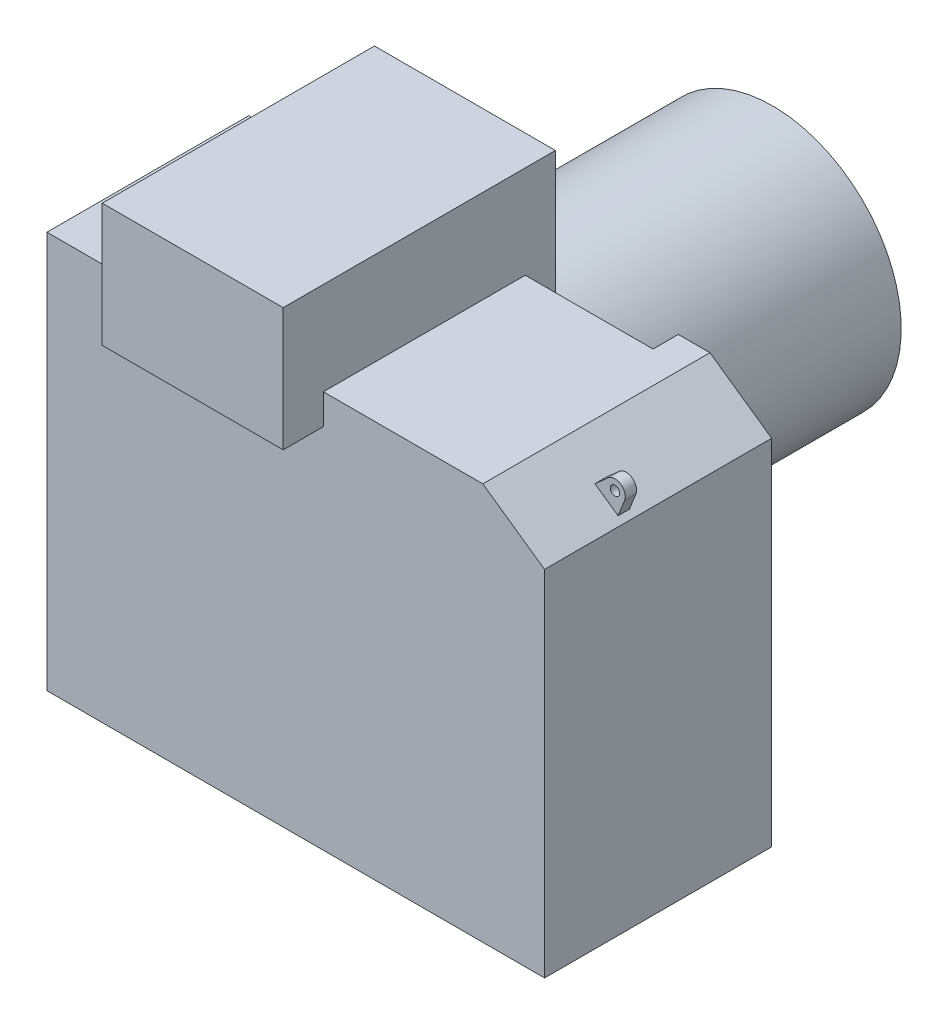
from build123d import *

# Parameters (mm, degrees)
EXTRUDE1_DEPTH              = 26.9875
F_1_4_20_TAPPED_HOLE1_D     = 5.1054
F_1_4_20_TAPPED_HOLE1_DEPTH = 6.604
F_1_4_20_TAPPED_HOLE1_TIP   = 1.533816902
EXTRUDE2_DEPTH              = 88.9
EXTRUDE3_DEPTH              = 9.525
EXTRUDE4_DEPTH              = 29.36875
SKETCH7_R                   = 32.258
F_28MM_LENS_DEPTH           = 50.8
SKETCH8_R                   = 1.4859
EXTRUDE6_DEPTH              = 3.556
EXTRUDE7_DEPTH              = 199.720733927
EXTRUDE7_DEPTH_BACK         = 199.720733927
SKETCH9_R                   = 1.4859
EXTRUDE8_DEPTH              = 3.556
SKETCH14_R                  = 40.64
F_17_35_LENS_DEPTH          = 106.68


with BuildPart() as part:
    # Sketch1 → Extrude1 (new body)
    with BuildSketch(Plane(origin=(0, 0, 0), x_dir=(1, 0, 0), z_dir=(0, 1, 0))):
        with BuildLine():
            Line((-58.7375, -38.1), (-58.7375, 34.13125))
            Line((-58.7375, 34.13125), (39.050158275, 34.13125))
            Line((39.050158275, 34.13125), (50.805618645, 27.352235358))
            ThreePointArc((50.805618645, 27.352235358), (61.306167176, 26.353321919), (68.939752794, 33.632588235))
            Line((68.939752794, 33.632588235), (98.425, 33.632588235))
            Line((98.425, 33.632588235), (98.425, -38.1))
            Line((98.425, -38.1), (-58.7375, -38.1))
        make_face()
    extrude(amount=EXTRUDE1_DEPTH)

    # 1_4-20 Tapped Hole1
    with Locations(Plane.XZ):
        with Locations((0, 0)):
            Hole(F_1_4_20_TAPPED_HOLE1_D / 2, depth=F_1_4_20_TAPPED_HOLE1_DEPTH)
            with Locations((0, 0, -(F_1_4_20_TAPPED_HOLE1_DEPTH + F_1_4_20_TAPPED_HOLE1_TIP / 2))):  # 118° drill point
                Cone(0, F_1_4_20_TAPPED_HOLE1_D / 2, F_1_4_20_TAPPED_HOLE1_TIP, mode=Mode.SUBTRACT)

    # Sketch4 → Extrude2 (add)
    with BuildSketch(Plane(origin=(0, 26.9875, 0), x_dir=(1, 0, 0), z_dir=(0, 1, 0))):
        Polygon((-58.7375, 25.654), (68.939752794, 25.654), (68.939752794, 33.632588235), (98.425, 33.632588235), (98.425, -38.1), (-58.7375, -38.1), align=None)
    extrude(amount=EXTRUDE2_DEPTH)

    # Sketch5 → Extrude3 (add)
    with BuildSketch(Plane(origin=(0, 115.8875, 0), x_dir=(1, 0, 0), z_dir=(0, 1, 0))):
        Polygon((-28.575, 25.654), (-28.575, 35.179), (28.575, 35.179), (28.575, 25.654), (68.939752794, 25.654), (68.939752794, 33.632588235), (98.425, 33.632588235), (98.425, -38.1), (28.575, -38.1), (28.575, -50.8), (-28.575, -50.8), (-28.575, -38.1), (-58.7375, -38.1), (-58.7375, 25.654), align=None)
    extrude(amount=EXTRUDE3_DEPTH)

    # Sketch6 → Extrude4 (add)
    with BuildSketch(Plane(origin=(0, 125.4125, 0), x_dir=(1, 0, 0), z_dir=(0, 1, 0))):
        Polygon((28.575, -38.1), (28.575, 35.179), (-28.575, 35.179), (-28.575, -38.1), (-28.575, -50.8), (28.575, -50.8), align=None)
    extrude(amount=EXTRUDE4_DEPTH)

    # Sketch7 → 28mm Lens (add)
    with BuildSketch(Plane(origin=(0, 0, -25.654), x_dir=(-1, 0, 0), z_dir=(0, 0, -1))):
        with Locations(Location((0, 63.5, 0), (0, 0, 180))):
            Circle(SKETCH7_R)
    extrude(amount=F_28MM_LENS_DEPTH)

    # Sketch8 → Extrude6 (add)
    with BuildSketch(Plane.XY.offset(7.9375)):
        with BuildLine():
            Line((-66.236888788, 117.354823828), (-58.7375, 120.176496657))
            Line((-58.7375, 120.176496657), (-58.7375, 108.423503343))
            Line((-58.7375, 108.423503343), (-66.236888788, 111.245176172))
            ThreePointArc((-66.236888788, 111.245176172), (-68.3514, 114.3), (-66.236888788, 117.354823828))
        make_face()
        with Locations((-65.0875, 114.3)):
            Circle(SKETCH8_R, mode=Mode.SUBTRACT)
    extrude(amount=EXTRUDE6_DEPTH)

    # Sketch10 → Extrude7 (cut, two sides: drawn at the far end of the back side and taken through both)
    with BuildSketch(Plane.XY.offset(-EXTRUDE7_DEPTH_BACK)):
        Polygon((69.022458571, 132.347881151), (127.827541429, 91.172118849), (127.827541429, 127.381926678), align=None)
    extrude(amount=EXTRUDE7_DEPTH + EXTRUDE7_DEPTH_BACK, mode=Mode.SUBTRACT)

    # Sketch9 → Extrude8 (add)
    with BuildSketch(Plane.XY.offset(9.525)):
        with BuildLine():
            Line((96.624308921, 113.020857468), (89.322976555, 118.133305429))
            Line((89.322976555, 118.133305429), (93.476080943, 121.832207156))
            ThreePointArc((93.476080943, 121.832207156), (97.518971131, 122.068483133), (98.67969422, 118.188597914))
            Line((98.67969422, 118.188597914), (96.624308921, 113.020857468))
        make_face()
        with Locations((95.646875, 119.394852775)):
            Circle(SKETCH9_R, mode=Mode.SUBTRACT)
    extrude(amount=EXTRUDE8_DEPTH)

    # Sketch14 → 17-35 lens (add)
    with BuildSketch(Plane(origin=(0, 0, -25.654), x_dir=(-1, 0, 0), z_dir=(0, 0, -1))):
        with Locations(Location((0, 63.5, 0), (0, 0, 243.95343764))):
            Circle(SKETCH14_R)
    extrude(amount=F_17_35_LENS_DEPTH)


solid = part.part
